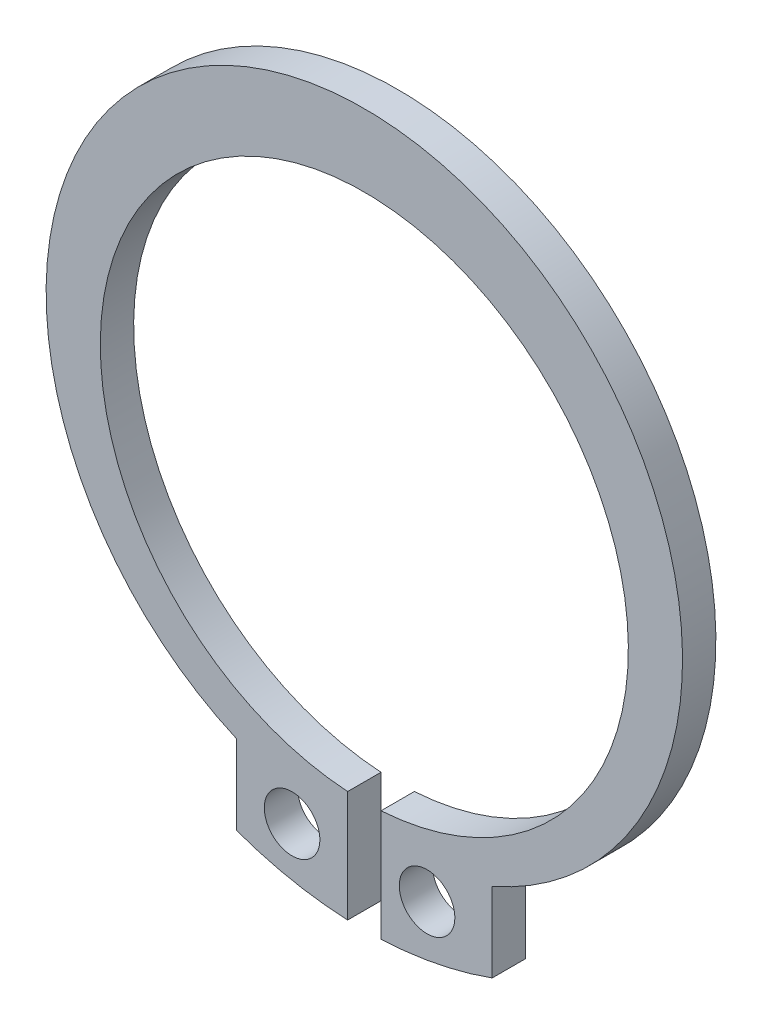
ISO-10303-21;
HEADER;
FILE_DESCRIPTION(('STEP AP214'),'2;1');
FILE_NAME('part.step','',(''),(''),'','','');
FILE_SCHEMA(('AUTOMOTIVE_DESIGN { 1 0 10303 214 1 1 1 1 }'));
ENDSEC;
DATA;
#1=APPLICATION_CONTEXT('core data for automotive mechanical design processes');
#2=APPLICATION_PROTOCOL_DEFINITION('international standard','automotive_design',2000,#1);
#3=PRODUCT_CONTEXT('',#1,'mechanical');
#4=PRODUCT('Part','Part','',(#3));
#5=PRODUCT_RELATED_PRODUCT_CATEGORY('part','',(#4));
#6=PRODUCT_DEFINITION_FORMATION('','',#4);
#7=PRODUCT_DEFINITION_CONTEXT('part definition',#1,'design');
#8=PRODUCT_DEFINITION('design','',#6,#7);
#9=PRODUCT_DEFINITION_SHAPE('','',#8);
#10=(LENGTH_UNIT() NAMED_UNIT(*) SI_UNIT(.MILLI.,.METRE.));
#11=(NAMED_UNIT(*) PLANE_ANGLE_UNIT() SI_UNIT($,.RADIAN.));
#12=(NAMED_UNIT(*) SI_UNIT($,.STERADIAN.) SOLID_ANGLE_UNIT());
#13=UNCERTAINTY_MEASURE_WITH_UNIT(LENGTH_MEASURE(1.E-05),#10,'distance_accuracy_value','');
#14=(GEOMETRIC_REPRESENTATION_CONTEXT(3) GLOBAL_UNCERTAINTY_ASSIGNED_CONTEXT((#13)) GLOBAL_UNIT_ASSIGNED_CONTEXT((#10,
#11,#12)) REPRESENTATION_CONTEXT('',''));
#15=CARTESIAN_POINT('',(0.,0.,0.));
#16=DIRECTION('',(0.,0.,1.));
#17=DIRECTION('',(1.,0.,0.));
#18=AXIS2_PLACEMENT_3D('',#15,#16,#17);
#19=CARTESIAN_POINT('',(-0.422222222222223,-9.4906126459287,1.2));
#20=DIRECTION('',(-1.,0.,0.));
#21=DIRECTION('',(0.,0.,1.));
#22=AXIS2_PLACEMENT_3D('',#19,#20,#21);
#23=PLANE('',#22);
#24=DIRECTION('',(0.,1.,0.));
#25=VECTOR('',#24,1.);
#26=CARTESIAN_POINT('',(-0.422222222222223,-9.4906126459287,0.));
#27=LINE('',#26,#25);
#28=CARTESIAN_POINT('',(-0.422222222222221,-9.4906126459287,0.));
#29=VERTEX_POINT('',#28);
#30=CARTESIAN_POINT('',(-0.422222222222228,-5.4849862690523,0.));
#31=VERTEX_POINT('',#30);
#32=EDGE_CURVE('E97',#29,#31,#27,.T.);
#33=ORIENTED_EDGE('',*,*,#32,.T.);
#34=DIRECTION('',(0.,0.,-1.));
#35=VECTOR('',#34,1.);
#36=CARTESIAN_POINT('',(-0.422222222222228,-5.4849862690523,1.2));
#37=LINE('',#36,#35);
#38=CARTESIAN_POINT('',(-0.422222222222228,-5.4849862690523,1.2));
#39=VERTEX_POINT('',#38);
#40=EDGE_CURVE('E11',#39,#31,#37,.T.);
#41=ORIENTED_EDGE('',*,*,#40,.F.);
#42=DIRECTION('',(0.,1.,0.));
#43=VECTOR('',#42,1.);
#44=CARTESIAN_POINT('',(-0.422222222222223,-9.4906126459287,1.2));
#45=LINE('',#44,#43);
#46=CARTESIAN_POINT('',(-0.422222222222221,-9.4906126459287,1.2));
#47=VERTEX_POINT('',#46);
#48=EDGE_CURVE('E117',#47,#39,#45,.T.);
#49=ORIENTED_EDGE('',*,*,#48,.F.);
#50=DIRECTION('',(0.,0.,-1.));
#51=VECTOR('',#50,1.);
#52=CARTESIAN_POINT('',(-0.422222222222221,-9.4906126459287,1.2));
#53=LINE('',#52,#51);
#54=EDGE_CURVE('E132',#47,#29,#53,.T.);
#55=ORIENTED_EDGE('',*,*,#54,.T.);
#56=EDGE_LOOP('',(#33,#41,#49,#55));
#57=FACE_BOUND('',#56,.T.);
#58=ADVANCED_FACE('F16',(#57),#23,.F.);
#59=CARTESIAN_POINT('',(0.177777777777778,3.99604742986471,1.2));
#60=DIRECTION('',(0.,0.,-1.));
#61=DIRECTION('',(-1.,0.,0.));
#62=AXIS2_PLACEMENT_3D('',#59,#60,#61);
#63=CYLINDRICAL_SURFACE('',#62,9.5);
#64=CARTESIAN_POINT('',(0.177777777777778,3.99604742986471,0.));
#65=DIRECTION('',(0.,0.,1.));
#66=DIRECTION('',(0.,1.,0.));
#67=AXIS2_PLACEMENT_3D('',#64,#65,#66);
#68=CIRCLE('',#67,9.5);
#69=CARTESIAN_POINT('',(0.777777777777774,-5.4849862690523,0.));
#70=VERTEX_POINT('',#69);
#71=EDGE_CURVE('E91',#70,#31,#68,.T.);
#72=ORIENTED_EDGE('',*,*,#71,.F.);
#73=DIRECTION('',(0.,0.,-1.));
#74=VECTOR('',#73,1.);
#75=CARTESIAN_POINT('',(0.777777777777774,-5.4849862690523,1.2));
#76=LINE('',#75,#74);
#77=CARTESIAN_POINT('',(0.777777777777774,-5.4849862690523,1.2));
#78=VERTEX_POINT('',#77);
#79=EDGE_CURVE('E19',#78,#70,#76,.T.);
#80=ORIENTED_EDGE('',*,*,#79,.F.);
#81=CARTESIAN_POINT('',(0.177777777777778,3.99604742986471,1.2));
#82=DIRECTION('',(0.,0.,1.));
#83=DIRECTION('',(0.,1.,0.));
#84=AXIS2_PLACEMENT_3D('',#81,#82,#83);
#85=CIRCLE('',#84,9.5);
#86=EDGE_CURVE('E120',#78,#39,#85,.T.);
#87=ORIENTED_EDGE('',*,*,#86,.T.);
#88=ORIENTED_EDGE('',*,*,#40,.T.);
#89=EDGE_LOOP('',(#72,#80,#87,#88));
#90=FACE_BOUND('',#89,.T.);
#91=ADVANCED_FACE('F92',(#90),#63,.F.);
#92=CARTESIAN_POINT('',(0.777777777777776,-9.4906126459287,1.2));
#93=DIRECTION('',(-1.,0.,0.));
#94=DIRECTION('',(0.,-1.,0.));
#95=AXIS2_PLACEMENT_3D('',#92,#93,#94);
#96=PLANE('',#95);
#97=DIRECTION('',(0.,1.,0.));
#98=VECTOR('',#97,1.);
#99=CARTESIAN_POINT('',(0.777777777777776,-9.4906126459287,0.));
#100=LINE('',#99,#98);
#101=CARTESIAN_POINT('',(0.777777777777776,-9.4906126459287,0.));
#102=VERTEX_POINT('',#101);
#103=EDGE_CURVE('E83',#102,#70,#100,.T.);
#104=ORIENTED_EDGE('',*,*,#103,.F.);
#105=DIRECTION('',(0.,0.,-1.));
#106=VECTOR('',#105,1.);
#107=CARTESIAN_POINT('',(0.777777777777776,-9.4906126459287,1.2));
#108=LINE('',#107,#106);
#109=CARTESIAN_POINT('',(0.777777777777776,-9.4906126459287,1.2));
#110=VERTEX_POINT('',#109);
#111=EDGE_CURVE('E89',#110,#102,#108,.T.);
#112=ORIENTED_EDGE('',*,*,#111,.F.);
#113=DIRECTION('',(0.,1.,0.));
#114=VECTOR('',#113,1.);
#115=CARTESIAN_POINT('',(0.777777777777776,-9.4906126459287,1.2));
#116=LINE('',#115,#114);
#117=EDGE_CURVE('E85',#110,#78,#116,.T.);
#118=ORIENTED_EDGE('',*,*,#117,.T.);
#119=ORIENTED_EDGE('',*,*,#79,.T.);
#120=EDGE_LOOP('',(#104,#112,#118,#119));
#121=FACE_BOUND('',#120,.T.);
#122=ADVANCED_FACE('F81',(#121),#96,.T.);
#123=CARTESIAN_POINT('',(0.177777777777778,3.99604742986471,1.2));
#124=DIRECTION('',(0.,0.,-1.));
#125=DIRECTION('',(-1.,0.,0.));
#126=AXIS2_PLACEMENT_3D('',#123,#124,#125);
#127=CYLINDRICAL_SURFACE('',#126,13.5);
#128=CARTESIAN_POINT('',(0.177777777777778,3.99604742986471,0.));
#129=DIRECTION('',(0.,0.,1.));
#130=DIRECTION('',(0.,1.,0.));
#131=AXIS2_PLACEMENT_3D('',#128,#129,#130);
#132=CIRCLE('',#131,13.5);
#133=CARTESIAN_POINT('',(4.77777777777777,-8.69607611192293,0.));
#134=VERTEX_POINT('',#133);
#135=EDGE_CURVE('E102',#102,#134,#132,.T.);
#136=ORIENTED_EDGE('',*,*,#135,.T.);
#137=DIRECTION('',(0.,0.,-1.));
#138=VECTOR('',#137,1.);
#139=CARTESIAN_POINT('',(4.77777777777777,-8.69607611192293,1.2));
#140=LINE('',#139,#138);
#141=CARTESIAN_POINT('',(4.77777777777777,-8.69607611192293,1.2));
#142=VERTEX_POINT('',#141);
#143=EDGE_CURVE('E142',#142,#134,#140,.T.);
#144=ORIENTED_EDGE('',*,*,#143,.F.);
#145=CARTESIAN_POINT('',(0.177777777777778,3.99604742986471,1.2));
#146=DIRECTION('',(0.,0.,1.));
#147=DIRECTION('',(0.,1.,0.));
#148=AXIS2_PLACEMENT_3D('',#145,#146,#147);
#149=CIRCLE('',#148,13.5);
#150=EDGE_CURVE('E123',#110,#142,#149,.T.);
#151=ORIENTED_EDGE('',*,*,#150,.F.);
#152=ORIENTED_EDGE('',*,*,#111,.T.);
#153=EDGE_LOOP('',(#136,#144,#151,#152));
#154=FACE_BOUND('',#153,.T.);
#155=ADVANCED_FACE('F147',(#154),#127,.T.);
#156=CARTESIAN_POINT('',(4.77777777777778,-8.69607611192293,1.2));
#157=DIRECTION('',(-1.,0.,0.));
#158=DIRECTION('',(0.,0.,1.));
#159=AXIS2_PLACEMENT_3D('',#156,#157,#158);
#160=PLANE('',#159);
#161=DIRECTION('',(0.,1.,0.));
#162=VECTOR('',#161,1.);
#163=CARTESIAN_POINT('',(4.77777777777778,-8.69607611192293,0.));
#164=LINE('',#163,#162);
#165=CARTESIAN_POINT('',(4.77777777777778,-5.83929948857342,0.));
#166=VERTEX_POINT('',#165);
#167=EDGE_CURVE('E104',#134,#166,#164,.T.);
#168=ORIENTED_EDGE('',*,*,#167,.T.);
#169=DIRECTION('',(0.,0.,-1.));
#170=VECTOR('',#169,1.);
#171=CARTESIAN_POINT('',(4.77777777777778,-5.83929948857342,1.2));
#172=LINE('',#171,#170);
#173=CARTESIAN_POINT('',(4.77777777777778,-5.83929948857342,1.2));
#174=VERTEX_POINT('',#173);
#175=EDGE_CURVE('E139',#174,#166,#172,.T.);
#176=ORIENTED_EDGE('',*,*,#175,.F.);
#177=DIRECTION('',(0.,1.,0.));
#178=VECTOR('',#177,1.);
#179=CARTESIAN_POINT('',(4.77777777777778,-8.69607611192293,1.2));
#180=LINE('',#179,#178);
#181=EDGE_CURVE('E125',#142,#174,#180,.T.);
#182=ORIENTED_EDGE('',*,*,#181,.F.);
#183=ORIENTED_EDGE('',*,*,#143,.T.);
#184=EDGE_LOOP('',(#168,#176,#182,#183));
#185=FACE_BOUND('',#184,.T.);
#186=ADVANCED_FACE('F163',(#185),#160,.F.);
#187=CARTESIAN_POINT('',(0.177777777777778,4.64604742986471,1.2));
#188=DIRECTION('',(0.,0.,-1.));
#189=DIRECTION('',(-1.,0.,0.));
#190=AXIS2_PLACEMENT_3D('',#187,#188,#189);
#191=CYLINDRICAL_SURFACE('',#190,11.45);
#192=CARTESIAN_POINT('',(0.177777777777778,4.64604742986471,0.));
#193=DIRECTION('',(0.,0.,1.));
#194=DIRECTION('',(0.,1.,0.));
#195=AXIS2_PLACEMENT_3D('',#192,#193,#194);
#196=CIRCLE('',#195,11.45);
#197=CARTESIAN_POINT('',(-4.42222222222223,-5.83929948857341,0.));
#198=VERTEX_POINT('',#197);
#199=EDGE_CURVE('E109',#166,#198,#196,.T.);
#200=ORIENTED_EDGE('',*,*,#199,.T.);
#201=DIRECTION('',(0.,0.,-1.));
#202=VECTOR('',#201,1.);
#203=CARTESIAN_POINT('',(-4.42222222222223,-5.83929948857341,1.2));
#204=LINE('',#203,#202);
#205=CARTESIAN_POINT('',(-4.42222222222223,-5.83929948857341,1.2));
#206=VERTEX_POINT('',#205);
#207=EDGE_CURVE('E137',#206,#198,#204,.T.);
#208=ORIENTED_EDGE('',*,*,#207,.F.);
#209=CARTESIAN_POINT('',(0.177777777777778,4.64604742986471,1.2));
#210=DIRECTION('',(0.,0.,1.));
#211=DIRECTION('',(0.,1.,0.));
#212=AXIS2_PLACEMENT_3D('',#209,#210,#211);
#213=CIRCLE('',#212,11.45);
#214=EDGE_CURVE('E127',#174,#206,#213,.T.);
#215=ORIENTED_EDGE('',*,*,#214,.F.);
#216=ORIENTED_EDGE('',*,*,#175,.T.);
#217=EDGE_LOOP('',(#200,#208,#215,#216));
#218=FACE_BOUND('',#217,.T.);
#219=ADVANCED_FACE('F160',(#218),#191,.T.);
#220=CARTESIAN_POINT('',(-4.42222222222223,-8.69607611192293,1.2));
#221=DIRECTION('',(-1.,0.,0.));
#222=DIRECTION('',(0.,0.,1.));
#223=AXIS2_PLACEMENT_3D('',#220,#221,#222);
#224=PLANE('',#223);
#225=DIRECTION('',(0.,1.,0.));
#226=VECTOR('',#225,1.);
#227=CARTESIAN_POINT('',(-4.42222222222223,-8.69607611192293,0.));
#228=LINE('',#227,#226);
#229=CARTESIAN_POINT('',(-4.42222222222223,-8.69607611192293,0.));
#230=VERTEX_POINT('',#229);
#231=EDGE_CURVE('E112',#230,#198,#228,.T.);
#232=ORIENTED_EDGE('',*,*,#231,.F.);
#233=DIRECTION('',(0.,0.,-1.));
#234=VECTOR('',#233,1.);
#235=CARTESIAN_POINT('',(-4.42222222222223,-8.69607611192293,1.2));
#236=LINE('',#235,#234);
#237=CARTESIAN_POINT('',(-4.42222222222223,-8.69607611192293,1.2));
#238=VERTEX_POINT('',#237);
#239=EDGE_CURVE('E38',#238,#230,#236,.T.);
#240=ORIENTED_EDGE('',*,*,#239,.F.);
#241=DIRECTION('',(0.,1.,0.));
#242=VECTOR('',#241,1.);
#243=CARTESIAN_POINT('',(-4.42222222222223,-8.69607611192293,1.2));
#244=LINE('',#243,#242);
#245=EDGE_CURVE('E129',#238,#206,#244,.T.);
#246=ORIENTED_EDGE('',*,*,#245,.T.);
#247=ORIENTED_EDGE('',*,*,#207,.T.);
#248=EDGE_LOOP('',(#232,#240,#246,#247));
#249=FACE_BOUND('',#248,.T.);
#250=ADVANCED_FACE('F156',(#249),#224,.T.);
#251=CARTESIAN_POINT('',(0.177777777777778,3.99604742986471,1.2));
#252=DIRECTION('',(0.,0.,-1.));
#253=DIRECTION('',(-1.,0.,0.));
#254=AXIS2_PLACEMENT_3D('',#251,#252,#253);
#255=CYLINDRICAL_SURFACE('',#254,13.5);
#256=CARTESIAN_POINT('',(0.177777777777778,3.99604742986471,0.));
#257=DIRECTION('',(0.,0.,1.));
#258=DIRECTION('',(0.,1.,0.));
#259=AXIS2_PLACEMENT_3D('',#256,#257,#258);
#260=CIRCLE('',#259,13.5);
#261=EDGE_CURVE('E115',#230,#29,#260,.T.);
#262=ORIENTED_EDGE('',*,*,#261,.T.);
#263=ORIENTED_EDGE('',*,*,#54,.F.);
#264=CARTESIAN_POINT('',(0.177777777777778,3.99604742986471,1.2));
#265=DIRECTION('',(0.,0.,1.));
#266=DIRECTION('',(0.,1.,0.));
#267=AXIS2_PLACEMENT_3D('',#264,#265,#266);
#268=CIRCLE('',#267,13.5);
#269=EDGE_CURVE('E30',#238,#47,#268,.T.);
#270=ORIENTED_EDGE('',*,*,#269,.F.);
#271=ORIENTED_EDGE('',*,*,#239,.T.);
#272=EDGE_LOOP('',(#262,#263,#270,#271));
#273=FACE_BOUND('',#272,.T.);
#274=ADVANCED_FACE('F205',(#273),#255,.T.);
#275=CARTESIAN_POINT('',(0.177777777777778,3.99604742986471,1.2));
#276=DIRECTION('',(0.,0.,1.));
#277=DIRECTION('',(1.,0.,0.));
#278=AXIS2_PLACEMENT_3D('',#275,#276,#277);
#279=PLANE('',#278);
#280=CARTESIAN_POINT('',(2.43492063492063,-7.4906126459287,1.2));
#281=DIRECTION('',(0.,0.,-1.));
#282=DIRECTION('',(0.,1.,0.));
#283=AXIS2_PLACEMENT_3D('',#280,#281,#282);
#284=CIRCLE('',#283,1.);
#285=CARTESIAN_POINT('',(2.43492063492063,-6.4906126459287,1.2));
#286=VERTEX_POINT('',#285);
#287=EDGE_CURVE('E246',#286,#286,#284,.T.);
#288=ORIENTED_EDGE('',*,*,#287,.T.);
#289=EDGE_LOOP('',(#288));
#290=FACE_BOUND('',#289,.T.);
#291=CARTESIAN_POINT('',(-2.42222222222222,-7.4906126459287,1.2));
#292=DIRECTION('',(0.,0.,-1.));
#293=DIRECTION('',(0.,1.,0.));
#294=AXIS2_PLACEMENT_3D('',#291,#292,#293);
#295=CIRCLE('',#294,1.);
#296=CARTESIAN_POINT('',(-2.42222222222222,-6.4906126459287,1.2));
#297=VERTEX_POINT('',#296);
#298=EDGE_CURVE('E119',#297,#297,#295,.T.);
#299=ORIENTED_EDGE('',*,*,#298,.T.);
#300=EDGE_LOOP('',(#299));
#301=FACE_BOUND('',#300,.T.);
#302=ORIENTED_EDGE('',*,*,#48,.T.);
#303=ORIENTED_EDGE('',*,*,#86,.F.);
#304=ORIENTED_EDGE('',*,*,#117,.F.);
#305=ORIENTED_EDGE('',*,*,#150,.T.);
#306=ORIENTED_EDGE('',*,*,#181,.T.);
#307=ORIENTED_EDGE('',*,*,#214,.T.);
#308=ORIENTED_EDGE('',*,*,#245,.F.);
#309=ORIENTED_EDGE('',*,*,#269,.T.);
#310=EDGE_LOOP('',(#302,#303,#304,#305,#306,#307,#308,#309));
#311=FACE_BOUND('',#310,.T.);
#312=ADVANCED_FACE('F150',(#290,#301,#311),#279,.T.);
#313=CARTESIAN_POINT('',(0.177777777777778,3.99604742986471,0.));
#314=DIRECTION('',(0.,0.,1.));
#315=DIRECTION('',(1.,0.,0.));
#316=AXIS2_PLACEMENT_3D('',#313,#314,#315);
#317=PLANE('',#316);
#318=CARTESIAN_POINT('',(2.43492063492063,-7.4906126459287,0.));
#319=DIRECTION('',(0.,0.,1.));
#320=DIRECTION('',(0.,1.,0.));
#321=AXIS2_PLACEMENT_3D('',#318,#319,#320);
#322=CIRCLE('',#321,1.);
#323=CARTESIAN_POINT('',(2.43492063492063,-6.4906126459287,0.));
#324=VERTEX_POINT('',#323);
#325=EDGE_CURVE('E249',#324,#324,#322,.T.);
#326=ORIENTED_EDGE('',*,*,#325,.T.);
#327=EDGE_LOOP('',(#326));
#328=FACE_BOUND('',#327,.T.);
#329=CARTESIAN_POINT('',(-2.42222222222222,-7.4906126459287,0.));
#330=DIRECTION('',(0.,0.,1.));
#331=DIRECTION('',(0.,1.,0.));
#332=AXIS2_PLACEMENT_3D('',#329,#330,#331);
#333=CIRCLE('',#332,1.);
#334=CARTESIAN_POINT('',(-2.42222222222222,-6.4906126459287,0.));
#335=VERTEX_POINT('',#334);
#336=EDGE_CURVE('E251',#335,#335,#333,.T.);
#337=ORIENTED_EDGE('',*,*,#336,.T.);
#338=EDGE_LOOP('',(#337));
#339=FACE_BOUND('',#338,.T.);
#340=ORIENTED_EDGE('',*,*,#32,.F.);
#341=ORIENTED_EDGE('',*,*,#261,.F.);
#342=ORIENTED_EDGE('',*,*,#231,.T.);
#343=ORIENTED_EDGE('',*,*,#199,.F.);
#344=ORIENTED_EDGE('',*,*,#167,.F.);
#345=ORIENTED_EDGE('',*,*,#135,.F.);
#346=ORIENTED_EDGE('',*,*,#103,.T.);
#347=ORIENTED_EDGE('',*,*,#71,.T.);
#348=EDGE_LOOP('',(#340,#341,#342,#343,#344,#345,#346,#347));
#349=FACE_BOUND('',#348,.T.);
#350=ADVANCED_FACE('F100',(#328,#339,#349),#317,.F.);
#351=CARTESIAN_POINT('',(-2.42222222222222,-7.4906126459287,0.));
#352=DIRECTION('',(0.,0.,1.));
#353=DIRECTION('',(0.,1.,0.));
#354=AXIS2_PLACEMENT_3D('',#351,#352,#353);
#355=CYLINDRICAL_SURFACE('',#354,1.);
#356=ORIENTED_EDGE('',*,*,#298,.F.);
#357=EDGE_LOOP('',(#356));
#358=FACE_BOUND('',#357,.T.);
#359=ORIENTED_EDGE('',*,*,#336,.F.);
#360=EDGE_LOOP('',(#359));
#361=FACE_BOUND('',#360,.T.);
#362=ADVANCED_FACE('F225',(#358,#361),#355,.F.);
#363=CARTESIAN_POINT('',(2.43492063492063,-7.4906126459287,0.));
#364=DIRECTION('',(0.,0.,1.));
#365=DIRECTION('',(0.,1.,0.));
#366=AXIS2_PLACEMENT_3D('',#363,#364,#365);
#367=CYLINDRICAL_SURFACE('',#366,1.);
#368=ORIENTED_EDGE('',*,*,#287,.F.);
#369=EDGE_LOOP('',(#368));
#370=FACE_BOUND('',#369,.T.);
#371=ORIENTED_EDGE('',*,*,#325,.F.);
#372=EDGE_LOOP('',(#371));
#373=FACE_BOUND('',#372,.T.);
#374=ADVANCED_FACE('F233',(#370,#373),#367,.F.);
#375=CLOSED_SHELL('',(#58,#91,#122,#155,#186,#219,#250,#274,#312,#350,#362,#374));
#376=MANIFOLD_SOLID_BREP('B1',#375);
#377=ADVANCED_BREP_SHAPE_REPRESENTATION('',(#18,#376),#14);
#378=SHAPE_DEFINITION_REPRESENTATION(#9,#377);
ENDSEC;
END-ISO-10303-21;
